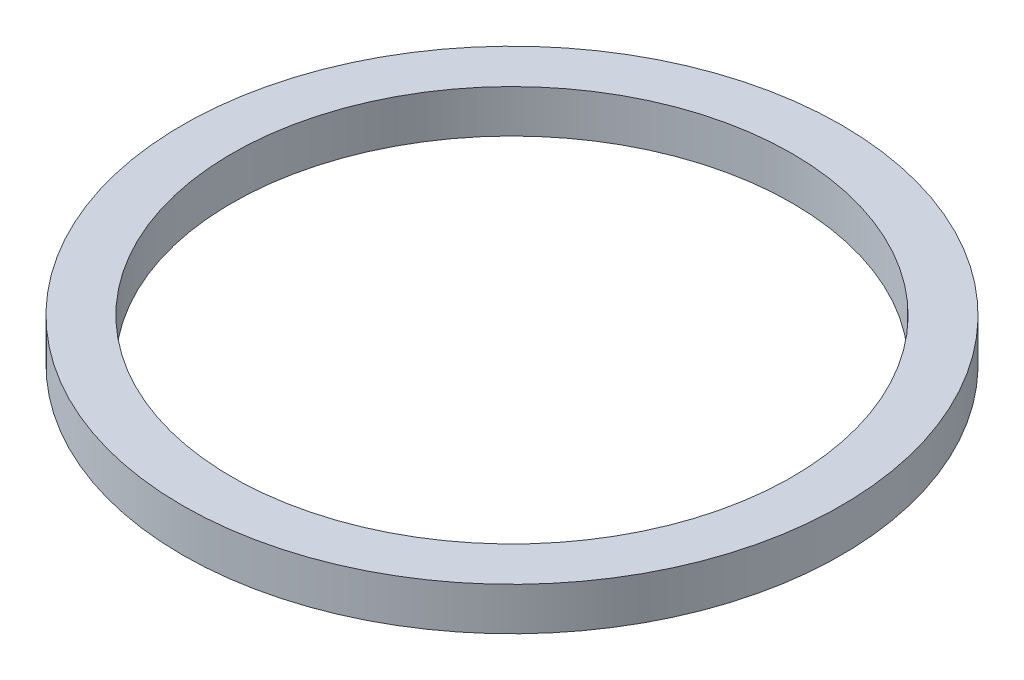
from build123d import *

# Parameters (mm, degrees)
SKETCH1_R      = 10
SKETCH1_R_2    = 8.5
EXTRUDE1_DEPTH = 1.3


with BuildPart() as part:
    # Sketch1 → Extrude1 (new body)
    with BuildSketch(Plane(origin=(0, 0, 0), x_dir=(1, 0, 0), z_dir=(0, 1, 0))):
        with Locations(Location((0, 0, 0), (0, 0, 270))):
            Circle(SKETCH1_R)
        with Locations(Location((0, 0, 0), (0, 0, 270))):
            Circle(SKETCH1_R_2, mode=Mode.SUBTRACT)
    extrude(amount=EXTRUDE1_DEPTH)


solid = part.part
